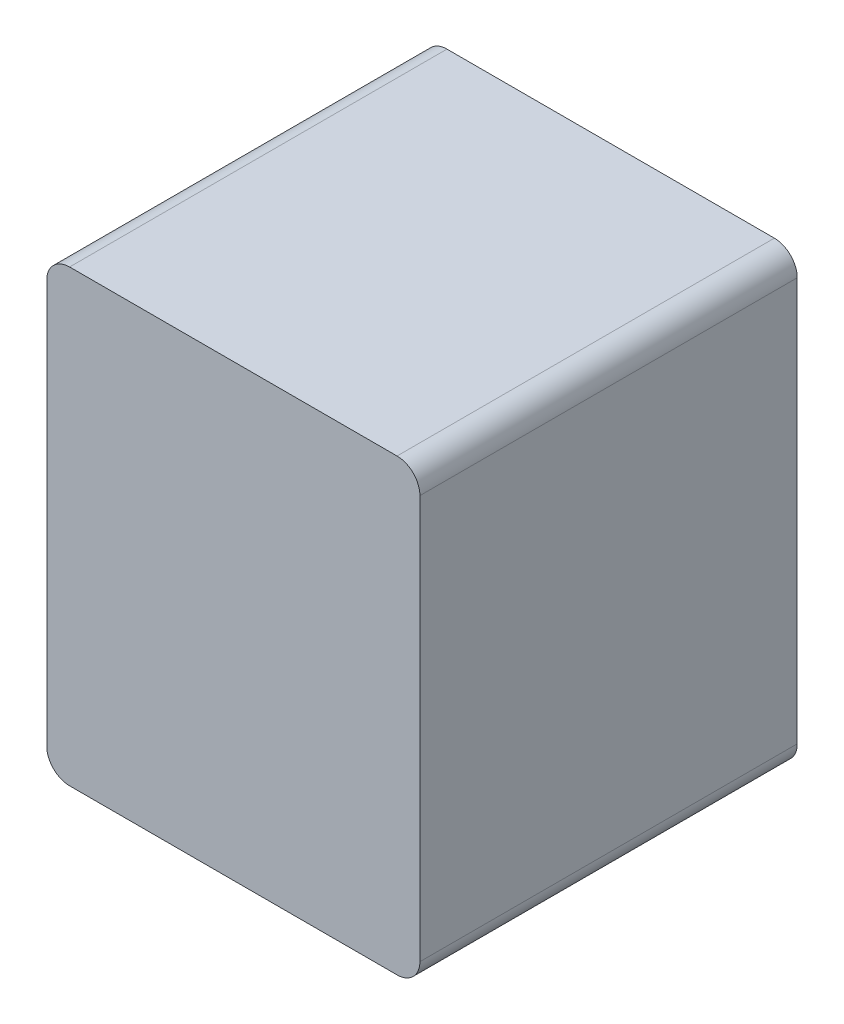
ISO-10303-21;
HEADER;
FILE_DESCRIPTION(('STEP AP214'),'2;1');
FILE_NAME('part.step','',(''),(''),'','','');
FILE_SCHEMA(('AUTOMOTIVE_DESIGN { 1 0 10303 214 1 1 1 1 }'));
ENDSEC;
DATA;
#1=APPLICATION_CONTEXT('core data for automotive mechanical design processes');
#2=APPLICATION_PROTOCOL_DEFINITION('international standard','automotive_design',2000,#1);
#3=PRODUCT_CONTEXT('',#1,'mechanical');
#4=PRODUCT('Part','Part','',(#3));
#5=PRODUCT_RELATED_PRODUCT_CATEGORY('part','',(#4));
#6=PRODUCT_DEFINITION_FORMATION('','',#4);
#7=PRODUCT_DEFINITION_CONTEXT('part definition',#1,'design');
#8=PRODUCT_DEFINITION('design','',#6,#7);
#9=PRODUCT_DEFINITION_SHAPE('','',#8);
#10=(LENGTH_UNIT() NAMED_UNIT(*) SI_UNIT(.MILLI.,.METRE.));
#11=(NAMED_UNIT(*) PLANE_ANGLE_UNIT() SI_UNIT($,.RADIAN.));
#12=(NAMED_UNIT(*) SI_UNIT($,.STERADIAN.) SOLID_ANGLE_UNIT());
#13=UNCERTAINTY_MEASURE_WITH_UNIT(LENGTH_MEASURE(1.E-05),#10,'distance_accuracy_value','');
#14=(GEOMETRIC_REPRESENTATION_CONTEXT(3) GLOBAL_UNCERTAINTY_ASSIGNED_CONTEXT((#13)) GLOBAL_UNIT_ASSIGNED_CONTEXT((#10,
#11,#12)) REPRESENTATION_CONTEXT('',''));
#15=CARTESIAN_POINT('',(0.,0.,0.));
#16=DIRECTION('',(0.,0.,1.));
#17=DIRECTION('',(1.,0.,0.));
#18=AXIS2_PLACEMENT_3D('',#15,#16,#17);
#19=CARTESIAN_POINT('',(429.5,-1129.5,990.));
#20=DIRECTION('',(0.,0.,-1.));
#21=DIRECTION('',(-1.,0.,0.));
#22=AXIS2_PLACEMENT_3D('',#19,#20,#21);
#23=CYLINDRICAL_SURFACE('',#22,60.0000000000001);
#24=CARTESIAN_POINT('',(429.5,-1129.5,0.));
#25=DIRECTION('',(0.,0.,1.));
#26=DIRECTION('',(1.,0.,0.));
#27=AXIS2_PLACEMENT_3D('',#24,#25,#26);
#28=CIRCLE('',#27,60.0000000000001);
#29=CARTESIAN_POINT('',(429.5,-1189.5,0.));
#30=VERTEX_POINT('',#29);
#31=CARTESIAN_POINT('',(489.5,-1129.5,0.));
#32=VERTEX_POINT('',#31);
#33=EDGE_CURVE('E127',#30,#32,#28,.T.);
#34=ORIENTED_EDGE('',*,*,#33,.T.);
#35=DIRECTION('',(0.,0.,-1.));
#36=VECTOR('',#35,1.);
#37=CARTESIAN_POINT('',(489.5,-1129.5,990.));
#38=LINE('',#37,#36);
#39=CARTESIAN_POINT('',(489.5,-1129.5,990.));
#40=VERTEX_POINT('',#39);
#41=EDGE_CURVE('E11',#40,#32,#38,.T.);
#42=ORIENTED_EDGE('',*,*,#41,.F.);
#43=CARTESIAN_POINT('',(429.5,-1129.5,990.));
#44=DIRECTION('',(0.,0.,1.));
#45=DIRECTION('',(1.,0.,0.));
#46=AXIS2_PLACEMENT_3D('',#43,#44,#45);
#47=CIRCLE('',#46,60.0000000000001);
#48=CARTESIAN_POINT('',(429.5,-1189.5,990.));
#49=VERTEX_POINT('',#48);
#50=EDGE_CURVE('E142',#49,#40,#47,.T.);
#51=ORIENTED_EDGE('',*,*,#50,.F.);
#52=DIRECTION('',(0.,0.,-1.));
#53=VECTOR('',#52,1.);
#54=CARTESIAN_POINT('',(429.5,-1189.5,990.));
#55=LINE('',#54,#53);
#56=EDGE_CURVE('E123',#49,#30,#55,.T.);
#57=ORIENTED_EDGE('',*,*,#56,.T.);
#58=EDGE_LOOP('',(#34,#42,#51,#57));
#59=FACE_BOUND('',#58,.T.);
#60=ADVANCED_FACE('F31',(#59),#23,.T.);
#61=CARTESIAN_POINT('',(489.5,-1129.5,990.));
#62=DIRECTION('',(-1.,0.,0.));
#63=DIRECTION('',(0.,-1.,0.));
#64=AXIS2_PLACEMENT_3D('',#61,#62,#63);
#65=PLANE('',#64);
#66=DIRECTION('',(0.,1.,0.));
#67=VECTOR('',#66,1.);
#68=CARTESIAN_POINT('',(489.5,-1129.5,0.));
#69=LINE('',#68,#67);
#70=CARTESIAN_POINT('',(489.5,-70.5,0.));
#71=VERTEX_POINT('',#70);
#72=EDGE_CURVE('E130',#32,#71,#69,.T.);
#73=ORIENTED_EDGE('',*,*,#72,.T.);
#74=DIRECTION('',(0.,0.,-1.));
#75=VECTOR('',#74,1.);
#76=CARTESIAN_POINT('',(489.5,-70.5,990.));
#77=LINE('',#76,#75);
#78=CARTESIAN_POINT('',(489.5,-70.5,990.));
#79=VERTEX_POINT('',#78);
#80=EDGE_CURVE('E39',#79,#71,#77,.T.);
#81=ORIENTED_EDGE('',*,*,#80,.F.);
#82=DIRECTION('',(0.,1.,0.));
#83=VECTOR('',#82,1.);
#84=CARTESIAN_POINT('',(489.5,-1129.5,990.));
#85=LINE('',#84,#83);
#86=EDGE_CURVE('E90',#40,#79,#85,.T.);
#87=ORIENTED_EDGE('',*,*,#86,.F.);
#88=ORIENTED_EDGE('',*,*,#41,.T.);
#89=EDGE_LOOP('',(#73,#81,#87,#88));
#90=FACE_BOUND('',#89,.T.);
#91=ADVANCED_FACE('F176',(#90),#65,.F.);
#92=CARTESIAN_POINT('',(429.5,-70.5,990.));
#93=DIRECTION('',(0.,0.,-1.));
#94=DIRECTION('',(-1.,0.,0.));
#95=AXIS2_PLACEMENT_3D('',#92,#93,#94);
#96=CYLINDRICAL_SURFACE('',#95,60.);
#97=CARTESIAN_POINT('',(429.5,-70.5,0.));
#98=DIRECTION('',(0.,0.,1.));
#99=DIRECTION('',(1.,0.,0.));
#100=AXIS2_PLACEMENT_3D('',#97,#98,#99);
#101=CIRCLE('',#100,60.);
#102=CARTESIAN_POINT('',(429.5,-10.5,0.));
#103=VERTEX_POINT('',#102);
#104=EDGE_CURVE('E132',#71,#103,#101,.T.);
#105=ORIENTED_EDGE('',*,*,#104,.T.);
#106=DIRECTION('',(0.,0.,-1.));
#107=VECTOR('',#106,1.);
#108=CARTESIAN_POINT('',(429.5,-10.5,990.));
#109=LINE('',#108,#107);
#110=CARTESIAN_POINT('',(429.5,-10.5,990.));
#111=VERTEX_POINT('',#110);
#112=EDGE_CURVE('E149',#111,#103,#109,.T.);
#113=ORIENTED_EDGE('',*,*,#112,.F.);
#114=CARTESIAN_POINT('',(429.5,-70.5,990.));
#115=DIRECTION('',(0.,0.,1.));
#116=DIRECTION('',(1.,0.,0.));
#117=AXIS2_PLACEMENT_3D('',#114,#115,#116);
#118=CIRCLE('',#117,60.);
#119=EDGE_CURVE('E157',#79,#111,#118,.T.);
#120=ORIENTED_EDGE('',*,*,#119,.F.);
#121=ORIENTED_EDGE('',*,*,#80,.T.);
#122=EDGE_LOOP('',(#105,#113,#120,#121));
#123=FACE_BOUND('',#122,.T.);
#124=ADVANCED_FACE('F155',(#123),#96,.T.);
#125=CARTESIAN_POINT('',(0.,-10.5000000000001,990.));
#126=DIRECTION('',(0.,-1.,0.));
#127=DIRECTION('',(1.,0.,0.));
#128=AXIS2_PLACEMENT_3D('',#125,#126,#127);
#129=PLANE('',#128);
#130=DIRECTION('',(-1.,0.,0.));
#131=VECTOR('',#130,1.);
#132=CARTESIAN_POINT('',(0.,-10.5000000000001,0.));
#133=LINE('',#132,#131);
#134=CARTESIAN_POINT('',(-429.5,-10.5000000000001,0.));
#135=VERTEX_POINT('',#134);
#136=EDGE_CURVE('E135',#103,#135,#133,.T.);
#137=ORIENTED_EDGE('',*,*,#136,.T.);
#138=DIRECTION('',(0.,0.,-1.));
#139=VECTOR('',#138,1.);
#140=CARTESIAN_POINT('',(-429.5,-10.5000000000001,990.));
#141=LINE('',#140,#139);
#142=CARTESIAN_POINT('',(-429.5,-10.5000000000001,990.));
#143=VERTEX_POINT('',#142);
#144=EDGE_CURVE('E146',#143,#135,#141,.T.);
#145=ORIENTED_EDGE('',*,*,#144,.F.);
#146=DIRECTION('',(-1.,0.,0.));
#147=VECTOR('',#146,1.);
#148=CARTESIAN_POINT('',(429.5,-10.5,990.));
#149=LINE('',#148,#147);
#150=EDGE_CURVE('E168',#111,#143,#149,.T.);
#151=ORIENTED_EDGE('',*,*,#150,.F.);
#152=ORIENTED_EDGE('',*,*,#112,.T.);
#153=EDGE_LOOP('',(#137,#145,#151,#152));
#154=FACE_BOUND('',#153,.T.);
#155=ADVANCED_FACE('F164',(#154),#129,.F.);
#156=CARTESIAN_POINT('',(-429.5,-70.5000000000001,990.));
#157=DIRECTION('',(0.,0.,-1.));
#158=DIRECTION('',(-1.,0.,0.));
#159=AXIS2_PLACEMENT_3D('',#156,#157,#158);
#160=CYLINDRICAL_SURFACE('',#159,60.);
#161=CARTESIAN_POINT('',(-429.5,-70.5000000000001,0.));
#162=DIRECTION('',(0.,0.,1.));
#163=DIRECTION('',(1.,0.,0.));
#164=AXIS2_PLACEMENT_3D('',#161,#162,#163);
#165=CIRCLE('',#164,60.);
#166=CARTESIAN_POINT('',(-489.5,-70.5000000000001,0.));
#167=VERTEX_POINT('',#166);
#168=EDGE_CURVE('E137',#135,#167,#165,.T.);
#169=ORIENTED_EDGE('',*,*,#168,.T.);
#170=DIRECTION('',(0.,0.,-1.));
#171=VECTOR('',#170,1.);
#172=CARTESIAN_POINT('',(-489.5,-70.5000000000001,990.));
#173=LINE('',#172,#171);
#174=CARTESIAN_POINT('',(-489.5,-70.5000000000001,990.));
#175=VERTEX_POINT('',#174);
#176=EDGE_CURVE('E118',#175,#167,#173,.T.);
#177=ORIENTED_EDGE('',*,*,#176,.F.);
#178=CARTESIAN_POINT('',(-429.5,-70.5000000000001,990.));
#179=DIRECTION('',(0.,0.,1.));
#180=DIRECTION('',(1.,0.,0.));
#181=AXIS2_PLACEMENT_3D('',#178,#179,#180);
#182=CIRCLE('',#181,60.);
#183=EDGE_CURVE('E109',#143,#175,#182,.T.);
#184=ORIENTED_EDGE('',*,*,#183,.F.);
#185=ORIENTED_EDGE('',*,*,#144,.T.);
#186=EDGE_LOOP('',(#169,#177,#184,#185));
#187=FACE_BOUND('',#186,.T.);
#188=ADVANCED_FACE('F167',(#187),#160,.T.);
#189=CARTESIAN_POINT('',(-489.5,-70.5000000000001,990.));
#190=DIRECTION('',(1.,0.,0.));
#191=DIRECTION('',(0.,1.,0.));
#192=AXIS2_PLACEMENT_3D('',#189,#190,#191);
#193=PLANE('',#192);
#194=DIRECTION('',(0.,-1.,0.));
#195=VECTOR('',#194,1.);
#196=CARTESIAN_POINT('',(-489.5,-70.5000000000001,0.));
#197=LINE('',#196,#195);
#198=CARTESIAN_POINT('',(-489.5,-1129.5,0.));
#199=VERTEX_POINT('',#198);
#200=EDGE_CURVE('E117',#167,#199,#197,.T.);
#201=ORIENTED_EDGE('',*,*,#200,.T.);
#202=DIRECTION('',(0.,0.,-1.));
#203=VECTOR('',#202,1.);
#204=CARTESIAN_POINT('',(-489.5,-1129.5,990.));
#205=LINE('',#204,#203);
#206=CARTESIAN_POINT('',(-489.5,-1129.5,990.));
#207=VERTEX_POINT('',#206);
#208=EDGE_CURVE('E114',#207,#199,#205,.T.);
#209=ORIENTED_EDGE('',*,*,#208,.F.);
#210=DIRECTION('',(0.,-1.,0.));
#211=VECTOR('',#210,1.);
#212=CARTESIAN_POINT('',(-489.5,-70.5000000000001,990.));
#213=LINE('',#212,#211);
#214=EDGE_CURVE('E103',#175,#207,#213,.T.);
#215=ORIENTED_EDGE('',*,*,#214,.F.);
#216=ORIENTED_EDGE('',*,*,#176,.T.);
#217=EDGE_LOOP('',(#201,#209,#215,#216));
#218=FACE_BOUND('',#217,.T.);
#219=ADVANCED_FACE('F115',(#218),#193,.F.);
#220=CARTESIAN_POINT('',(-429.5,-1129.5,990.));
#221=DIRECTION('',(0.,0.,-1.));
#222=DIRECTION('',(-1.,0.,0.));
#223=AXIS2_PLACEMENT_3D('',#220,#221,#222);
#224=CYLINDRICAL_SURFACE('',#223,60.0000000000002);
#225=CARTESIAN_POINT('',(-429.5,-1129.5,0.));
#226=DIRECTION('',(0.,0.,1.));
#227=DIRECTION('',(1.,0.,0.));
#228=AXIS2_PLACEMENT_3D('',#225,#226,#227);
#229=CIRCLE('',#228,60.0000000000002);
#230=CARTESIAN_POINT('',(-429.5,-1189.5,0.));
#231=VERTEX_POINT('',#230);
#232=EDGE_CURVE('E76',#199,#231,#229,.T.);
#233=ORIENTED_EDGE('',*,*,#232,.T.);
#234=DIRECTION('',(0.,0.,-1.));
#235=VECTOR('',#234,1.);
#236=CARTESIAN_POINT('',(-429.5,-1189.5,990.));
#237=LINE('',#236,#235);
#238=CARTESIAN_POINT('',(-429.5,-1189.5,990.));
#239=VERTEX_POINT('',#238);
#240=EDGE_CURVE('E119',#239,#231,#237,.T.);
#241=ORIENTED_EDGE('',*,*,#240,.F.);
#242=CARTESIAN_POINT('',(-429.5,-1129.5,990.));
#243=DIRECTION('',(0.,0.,1.));
#244=DIRECTION('',(1.,0.,0.));
#245=AXIS2_PLACEMENT_3D('',#242,#243,#244);
#246=CIRCLE('',#245,60.0000000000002);
#247=EDGE_CURVE('E107',#207,#239,#246,.T.);
#248=ORIENTED_EDGE('',*,*,#247,.F.);
#249=ORIENTED_EDGE('',*,*,#208,.T.);
#250=EDGE_LOOP('',(#233,#241,#248,#249));
#251=FACE_BOUND('',#250,.T.);
#252=ADVANCED_FACE('F121',(#251),#224,.T.);
#253=CARTESIAN_POINT('',(-429.5,-1189.5,990.));
#254=DIRECTION('',(0.,1.,0.));
#255=DIRECTION('',(-1.,0.,0.));
#256=AXIS2_PLACEMENT_3D('',#253,#254,#255);
#257=PLANE('',#256);
#258=DIRECTION('',(1.,0.,0.));
#259=VECTOR('',#258,1.);
#260=CARTESIAN_POINT('',(-429.5,-1189.5,0.));
#261=LINE('',#260,#259);
#262=EDGE_CURVE('E82',#231,#30,#261,.T.);
#263=ORIENTED_EDGE('',*,*,#262,.T.);
#264=ORIENTED_EDGE('',*,*,#56,.F.);
#265=DIRECTION('',(1.,0.,0.));
#266=VECTOR('',#265,1.);
#267=CARTESIAN_POINT('',(-429.5,-1189.5,990.));
#268=LINE('',#267,#266);
#269=EDGE_CURVE('E47',#239,#49,#268,.T.);
#270=ORIENTED_EDGE('',*,*,#269,.F.);
#271=ORIENTED_EDGE('',*,*,#240,.T.);
#272=EDGE_LOOP('',(#263,#264,#270,#271));
#273=FACE_BOUND('',#272,.T.);
#274=ADVANCED_FACE('F192',(#273),#257,.F.);
#275=CARTESIAN_POINT('',(429.5,-1129.5,990.));
#276=DIRECTION('',(0.,0.,1.));
#277=DIRECTION('',(1.,0.,0.));
#278=AXIS2_PLACEMENT_3D('',#275,#276,#277);
#279=PLANE('',#278);
#280=ORIENTED_EDGE('',*,*,#50,.T.);
#281=ORIENTED_EDGE('',*,*,#86,.T.);
#282=ORIENTED_EDGE('',*,*,#119,.T.);
#283=ORIENTED_EDGE('',*,*,#150,.T.);
#284=ORIENTED_EDGE('',*,*,#183,.T.);
#285=ORIENTED_EDGE('',*,*,#214,.T.);
#286=ORIENTED_EDGE('',*,*,#247,.T.);
#287=ORIENTED_EDGE('',*,*,#269,.T.);
#288=EDGE_LOOP('',(#280,#281,#282,#283,#284,#285,#286,#287));
#289=FACE_BOUND('',#288,.T.);
#290=ADVANCED_FACE('F105',(#289),#279,.T.);
#291=CARTESIAN_POINT('',(429.5,-1129.5,0.));
#292=DIRECTION('',(0.,0.,1.));
#293=DIRECTION('',(1.,0.,0.));
#294=AXIS2_PLACEMENT_3D('',#291,#292,#293);
#295=PLANE('',#294);
#296=ORIENTED_EDGE('',*,*,#33,.F.);
#297=ORIENTED_EDGE('',*,*,#262,.F.);
#298=ORIENTED_EDGE('',*,*,#232,.F.);
#299=ORIENTED_EDGE('',*,*,#200,.F.);
#300=ORIENTED_EDGE('',*,*,#168,.F.);
#301=ORIENTED_EDGE('',*,*,#136,.F.);
#302=ORIENTED_EDGE('',*,*,#104,.F.);
#303=ORIENTED_EDGE('',*,*,#72,.F.);
#304=EDGE_LOOP('',(#296,#297,#298,#299,#300,#301,#302,#303));
#305=FACE_BOUND('',#304,.T.);
#306=ADVANCED_FACE('F160',(#305),#295,.F.);
#307=CLOSED_SHELL('',(#60,#91,#124,#155,#188,#219,#252,#274,#290,#306));
#308=MANIFOLD_SOLID_BREP('B2',#307);
#309=ADVANCED_BREP_SHAPE_REPRESENTATION('',(#18,#308),#14);
#310=SHAPE_DEFINITION_REPRESENTATION(#9,#309);
ENDSEC;
END-ISO-10303-21;
